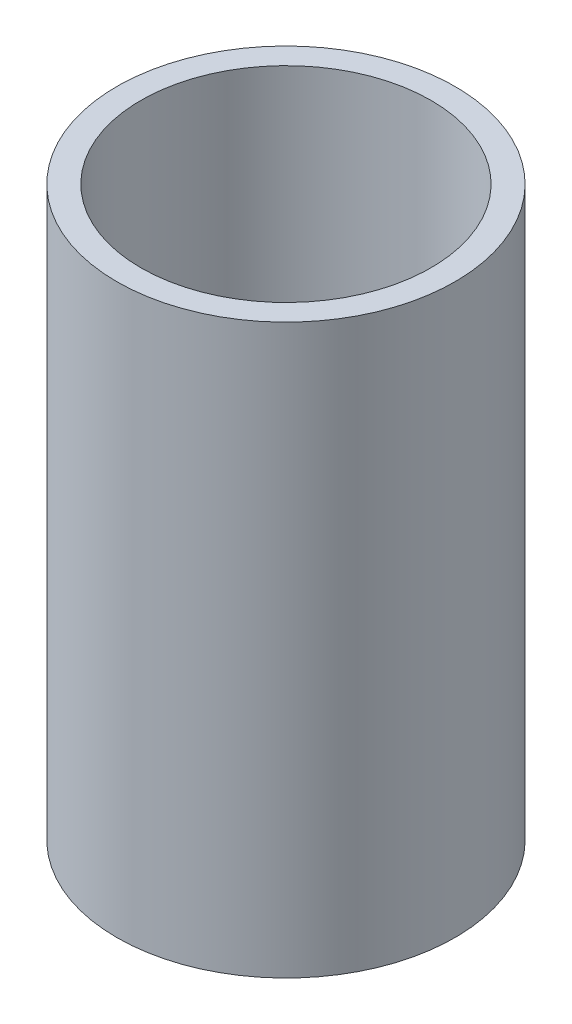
from build123d import *

# Parameters (mm, degrees)
SKETCH1_R           = 83.185
SKETCH1_R_2         = 71.352522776
BOSS_EXTRUDE1_DEPTH = 279.4
BOSS_EXTRUDE2_START = -12.7
SKETCH5_R           = 83.185
SKETCH5_R_2         = 71.352522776
BOSS_EXTRUDE2_DEPTH = 12.7


with BuildPart() as part:
    # Sketch1 → Boss-Extrude1 (new body)
    with BuildSketch(Plane(origin=(0, 0, 0), x_dir=(1, 0, 0), z_dir=(0, 1, 0))):
        with Locations(Location((0, 0, 0), (0, 0, 270))):
            Circle(SKETCH1_R)
        with Locations(Location((0, 0, 0), (0, 0, 270))):
            Circle(SKETCH1_R_2, mode=Mode.SUBTRACT)
    extrude(amount=BOSS_EXTRUDE1_DEPTH)

    # Sketch5 → Boss-Extrude2 (add)
    with BuildSketch(Plane(origin=(0, 279.4, 0), x_dir=(1, 0, 0), z_dir=(0, 1, 0)).offset(BOSS_EXTRUDE2_START)):
        with Locations(Location((0, 0, 0), (0, 0, 270))):
            Circle(SKETCH5_R)
        with Locations(Location((0, 0, 0), (0, 0, 270))):
            Circle(SKETCH5_R_2, mode=Mode.SUBTRACT)
    extrude(amount=BOSS_EXTRUDE2_DEPTH)

    # Sketch6 → Revolve1 (revolve)
    with BuildSketch(Plane(origin=(0, 28.1168, 0), x_dir=(-0.8420560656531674, 0, -0.539390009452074), z_dir=(0.5393900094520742, 0, -0.8420560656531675)), mode=Mode.PRIVATE) as revolve1_sk:
        Polygon((71.352522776, -28.1168), (68.177522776, -28.1168), (71.352522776, -24.9418), align=None)
    revolve(revolve1_sk.sketch.rotate(Axis((0, 0, 0), (0, 1, 0)), 122.642123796), axis=Axis((0, 0, 0), (0, 1, 0)))


solid = part.part
